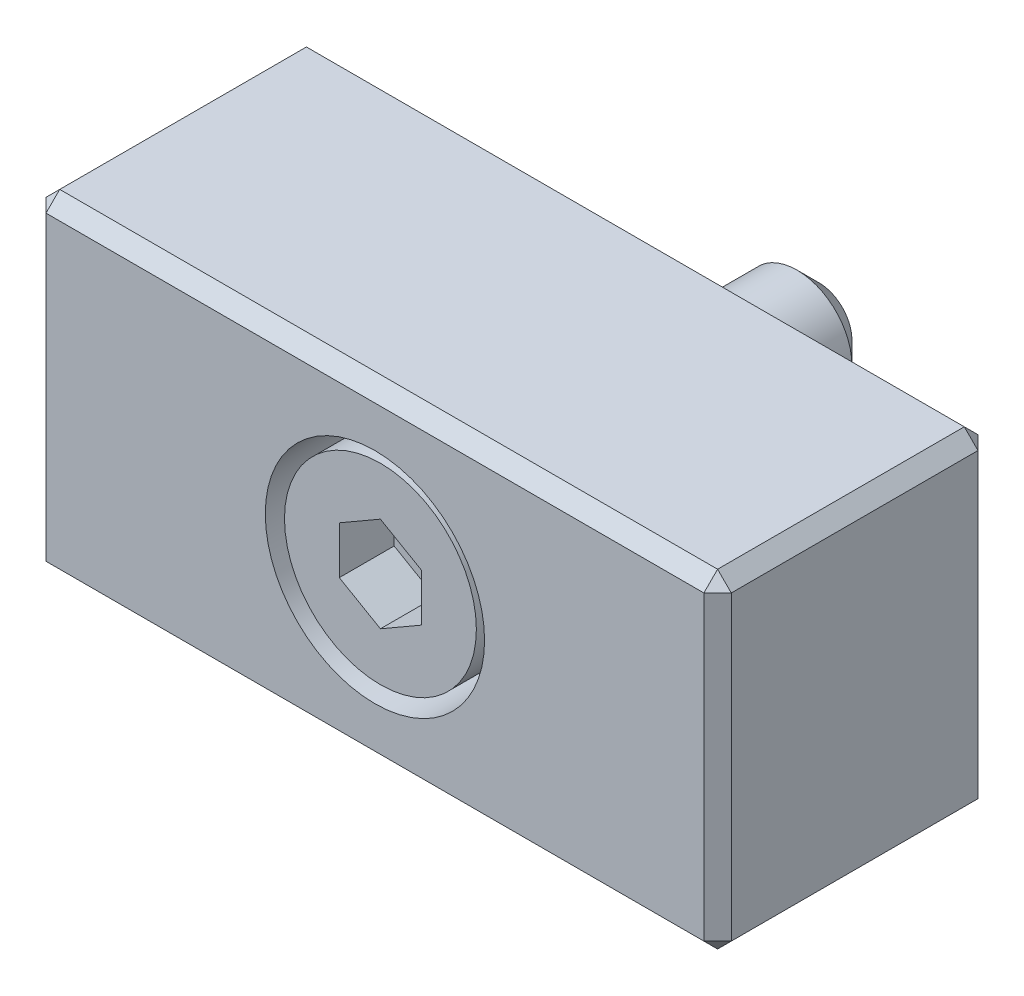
ISO-10303-21;
HEADER;
FILE_DESCRIPTION(('STEP AP214'),'2;1');
FILE_NAME('part.step','',(''),(''),'','','');
FILE_SCHEMA(('AUTOMOTIVE_DESIGN { 1 0 10303 214 1 1 1 1 }'));
ENDSEC;
DATA;
#1=APPLICATION_CONTEXT('core data for automotive mechanical design processes');
#2=APPLICATION_PROTOCOL_DEFINITION('international standard','automotive_design',2000,#1);
#3=PRODUCT_CONTEXT('',#1,'mechanical');
#4=PRODUCT('Part','Part','',(#3));
#5=PRODUCT_RELATED_PRODUCT_CATEGORY('part','',(#4));
#6=PRODUCT_DEFINITION_FORMATION('','',#4);
#7=PRODUCT_DEFINITION_CONTEXT('part definition',#1,'design');
#8=PRODUCT_DEFINITION('design','',#6,#7);
#9=PRODUCT_DEFINITION_SHAPE('','',#8);
#10=(LENGTH_UNIT() NAMED_UNIT(*) SI_UNIT(.MILLI.,.METRE.));
#11=(NAMED_UNIT(*) PLANE_ANGLE_UNIT() SI_UNIT($,.RADIAN.));
#12=(NAMED_UNIT(*) SI_UNIT($,.STERADIAN.) SOLID_ANGLE_UNIT());
#13=UNCERTAINTY_MEASURE_WITH_UNIT(LENGTH_MEASURE(1.E-05),#10,'distance_accuracy_value','');
#14=(GEOMETRIC_REPRESENTATION_CONTEXT(3) GLOBAL_UNCERTAINTY_ASSIGNED_CONTEXT((#13)) GLOBAL_UNIT_ASSIGNED_CONTEXT((#10,
#11,#12)) REPRESENTATION_CONTEXT('',''));
#15=CARTESIAN_POINT('',(0.,0.,0.));
#16=DIRECTION('',(0.,0.,1.));
#17=DIRECTION('',(1.,0.,0.));
#18=AXIS2_PLACEMENT_3D('',#15,#16,#17);
#19=CARTESIAN_POINT('',(2.,0.,-6.2));
#20=DIRECTION('',(0.,0.,-1.));
#21=DIRECTION('',(-1.,0.,0.));
#22=AXIS2_PLACEMENT_3D('',#19,#20,#21);
#23=PLANE('',#22);
#24=CARTESIAN_POINT('',(0.,0.,-6.2));
#25=DIRECTION('',(0.,0.,-1.));
#26=DIRECTION('',(-1.,0.,0.));
#27=AXIS2_PLACEMENT_3D('',#24,#25,#26);
#28=CIRCLE('',#27,1.2);
#29=CARTESIAN_POINT('',(-1.2,0.,-6.2));
#30=VERTEX_POINT('',#29);
#31=EDGE_CURVE('E24',#30,#30,#28,.T.);
#32=ORIENTED_EDGE('',*,*,#31,.T.);
#33=EDGE_LOOP('',(#32));
#34=FACE_BOUND('',#33,.T.);
#35=ADVANCED_FACE('F14',(#34),#23,.T.);
#36=CARTESIAN_POINT('',(0.,0.,-5.4));
#37=DIRECTION('',(0.,0.,1.));
#38=DIRECTION('',(1.,0.,0.));
#39=AXIS2_PLACEMENT_3D('',#36,#37,#38);
#40=CONICAL_SURFACE('',#39,2.,0.785398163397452);
#41=ORIENTED_EDGE('',*,*,#31,.F.);
#42=EDGE_LOOP('',(#41));
#43=FACE_BOUND('',#42,.T.);
#44=CARTESIAN_POINT('',(0.,0.,-5.4));
#45=DIRECTION('',(0.,0.,-1.));
#46=DIRECTION('',(-1.,0.,0.));
#47=AXIS2_PLACEMENT_3D('',#44,#45,#46);
#48=CIRCLE('',#47,2.);
#49=CARTESIAN_POINT('',(-2.,0.,-5.4));
#50=VERTEX_POINT('',#49);
#51=EDGE_CURVE('E199',#50,#50,#48,.F.);
#52=ORIENTED_EDGE('',*,*,#51,.F.);
#53=EDGE_LOOP('',(#52));
#54=FACE_BOUND('',#53,.T.);
#55=ADVANCED_FACE('F437',(#43,#54),#40,.T.);
#56=CARTESIAN_POINT('',(0.,0.,13.8));
#57=DIRECTION('',(0.,0.,1.));
#58=DIRECTION('',(1.,0.,0.));
#59=AXIS2_PLACEMENT_3D('',#56,#57,#58);
#60=CYLINDRICAL_SURFACE('',#59,2.);
#61=ORIENTED_EDGE('',*,*,#51,.T.);
#62=EDGE_LOOP('',(#61));
#63=FACE_BOUND('',#62,.T.);
#64=CARTESIAN_POINT('',(0.,0.,5.8));
#65=DIRECTION('',(0.,0.,1.));
#66=DIRECTION('',(1.,0.,0.));
#67=AXIS2_PLACEMENT_3D('',#64,#65,#66);
#68=CIRCLE('',#67,2.);
#69=CARTESIAN_POINT('',(2.,0.,5.8));
#70=VERTEX_POINT('',#69);
#71=EDGE_CURVE('E190',#70,#70,#68,.T.);
#72=ORIENTED_EDGE('',*,*,#71,.F.);
#73=EDGE_LOOP('',(#72));
#74=FACE_BOUND('',#73,.T.);
#75=ADVANCED_FACE('F444',(#63,#74),#60,.T.);
#76=CARTESIAN_POINT('',(3.5,0.,5.8));
#77=DIRECTION('',(0.,0.,-1.));
#78=DIRECTION('',(-1.,0.,0.));
#79=AXIS2_PLACEMENT_3D('',#76,#77,#78);
#80=PLANE('',#79);
#81=ORIENTED_EDGE('',*,*,#71,.T.);
#82=EDGE_LOOP('',(#81));
#83=FACE_BOUND('',#82,.T.);
#84=CARTESIAN_POINT('',(0.,0.,5.8));
#85=DIRECTION('',(0.,0.,-1.));
#86=DIRECTION('',(-1.,0.,0.));
#87=AXIS2_PLACEMENT_3D('',#84,#85,#86);
#88=CIRCLE('',#87,2.5);
#89=CARTESIAN_POINT('',(-2.5,0.,5.8));
#90=VERTEX_POINT('',#89);
#91=EDGE_CURVE('E9',#90,#90,#88,.T.);
#92=ORIENTED_EDGE('',*,*,#91,.T.);
#93=EDGE_LOOP('',(#92));
#94=FACE_BOUND('',#93,.T.);
#95=ADVANCED_FACE('F453',(#83,#94),#80,.T.);
#96=CARTESIAN_POINT('',(0.,1.73205080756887,7.8));
#97=DIRECTION('',(-0.5,-0.86602540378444,0.));
#98=DIRECTION('',(0.86602540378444,-0.5,0.));
#99=AXIS2_PLACEMENT_3D('',#96,#97,#98);
#100=PLANE('',#99);
#101=DIRECTION('',(0.,0.,1.));
#102=VECTOR('',#101,1.);
#103=CARTESIAN_POINT('',(1.5,0.866025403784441,7.8));
#104=LINE('',#103,#102);
#105=CARTESIAN_POINT('',(1.5,0.866025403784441,7.8));
#106=VERTEX_POINT('',#105);
#107=CARTESIAN_POINT('',(1.5,0.866025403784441,9.8));
#108=VERTEX_POINT('',#107);
#109=EDGE_CURVE('E119',#106,#108,#104,.T.);
#110=ORIENTED_EDGE('',*,*,#109,.T.);
#111=DIRECTION('',(0.86602540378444,-0.5,0.));
#112=VECTOR('',#111,1.);
#113=CARTESIAN_POINT('',(0.,1.73205080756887,9.8));
#114=LINE('',#113,#112);
#115=CARTESIAN_POINT('',(0.,1.73205080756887,9.8));
#116=VERTEX_POINT('',#115);
#117=EDGE_CURVE('E33',#116,#108,#114,.T.);
#118=ORIENTED_EDGE('',*,*,#117,.F.);
#119=DIRECTION('',(0.,0.,1.));
#120=VECTOR('',#119,1.);
#121=CARTESIAN_POINT('',(0.,1.73205080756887,7.8));
#122=LINE('',#121,#120);
#123=CARTESIAN_POINT('',(0.,1.73205080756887,7.8));
#124=VERTEX_POINT('',#123);
#125=EDGE_CURVE('E158',#124,#116,#122,.T.);
#126=ORIENTED_EDGE('',*,*,#125,.F.);
#127=DIRECTION('',(0.86602540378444,-0.5,0.));
#128=VECTOR('',#127,1.);
#129=CARTESIAN_POINT('',(0.,1.73205080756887,7.8));
#130=LINE('',#129,#128);
#131=EDGE_CURVE('E171',#124,#106,#130,.T.);
#132=ORIENTED_EDGE('',*,*,#131,.T.);
#133=EDGE_LOOP('',(#110,#118,#126,#132));
#134=FACE_BOUND('',#133,.T.);
#135=ADVANCED_FACE('F457',(#134),#100,.T.);
#136=CARTESIAN_POINT('',(1.5,-0.866025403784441,7.8));
#137=DIRECTION('',(1.,0.,0.));
#138=DIRECTION('',(0.,1.,0.));
#139=AXIS2_PLACEMENT_3D('',#136,#137,#138);
#140=PLANE('',#139);
#141=DIRECTION('',(0.,0.,1.));
#142=VECTOR('',#141,1.);
#143=CARTESIAN_POINT('',(1.5,-0.866025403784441,7.8));
#144=LINE('',#143,#142);
#145=CARTESIAN_POINT('',(1.5,-0.866025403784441,7.8));
#146=VERTEX_POINT('',#145);
#147=CARTESIAN_POINT('',(1.5,-0.866025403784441,9.8));
#148=VERTEX_POINT('',#147);
#149=EDGE_CURVE('E187',#146,#148,#144,.T.);
#150=ORIENTED_EDGE('',*,*,#149,.T.);
#151=DIRECTION('',(0.,1.,0.));
#152=VECTOR('',#151,1.);
#153=CARTESIAN_POINT('',(1.5,-0.866025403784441,9.8));
#154=LINE('',#153,#152);
#155=EDGE_CURVE('E759',#148,#108,#154,.T.);
#156=ORIENTED_EDGE('',*,*,#155,.T.);
#157=ORIENTED_EDGE('',*,*,#109,.F.);
#158=DIRECTION('',(0.,1.,0.));
#159=VECTOR('',#158,1.);
#160=CARTESIAN_POINT('',(1.5,-0.866025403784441,7.8));
#161=LINE('',#160,#159);
#162=EDGE_CURVE('E181',#146,#106,#161,.T.);
#163=ORIENTED_EDGE('',*,*,#162,.F.);
#164=EDGE_LOOP('',(#150,#156,#157,#163));
#165=FACE_BOUND('',#164,.T.);
#166=ADVANCED_FACE('F449',(#165),#140,.F.);
#167=CARTESIAN_POINT('',(0.,-1.73205080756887,7.8));
#168=DIRECTION('',(0.5,-0.86602540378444,0.));
#169=DIRECTION('',(0.86602540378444,0.5,0.));
#170=AXIS2_PLACEMENT_3D('',#167,#168,#169);
#171=PLANE('',#170);
#172=DIRECTION('',(0.,0.,1.));
#173=VECTOR('',#172,1.);
#174=CARTESIAN_POINT('',(0.,-1.73205080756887,7.8));
#175=LINE('',#174,#173);
#176=CARTESIAN_POINT('',(0.,-1.73205080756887,7.8));
#177=VERTEX_POINT('',#176);
#178=CARTESIAN_POINT('',(0.,-1.73205080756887,9.8));
#179=VERTEX_POINT('',#178);
#180=EDGE_CURVE('E185',#177,#179,#175,.T.);
#181=ORIENTED_EDGE('',*,*,#180,.T.);
#182=DIRECTION('',(0.86602540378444,0.5,0.));
#183=VECTOR('',#182,1.);
#184=CARTESIAN_POINT('',(0.,-1.73205080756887,9.8));
#185=LINE('',#184,#183);
#186=EDGE_CURVE('E762',#179,#148,#185,.T.);
#187=ORIENTED_EDGE('',*,*,#186,.T.);
#188=ORIENTED_EDGE('',*,*,#149,.F.);
#189=DIRECTION('',(0.86602540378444,0.5,0.));
#190=VECTOR('',#189,1.);
#191=CARTESIAN_POINT('',(0.,-1.73205080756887,7.8));
#192=LINE('',#191,#190);
#193=EDGE_CURVE('E178',#177,#146,#192,.T.);
#194=ORIENTED_EDGE('',*,*,#193,.F.);
#195=EDGE_LOOP('',(#181,#187,#188,#194));
#196=FACE_BOUND('',#195,.T.);
#197=ADVANCED_FACE('F723',(#196),#171,.F.);
#198=CARTESIAN_POINT('',(0.,-1.73205080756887,7.8));
#199=DIRECTION('',(0.5,0.86602540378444,0.));
#200=DIRECTION('',(-0.86602540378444,0.5,0.));
#201=AXIS2_PLACEMENT_3D('',#198,#199,#200);
#202=PLANE('',#201);
#203=DIRECTION('',(0.,0.,1.));
#204=VECTOR('',#203,1.);
#205=CARTESIAN_POINT('',(-1.5,-0.866025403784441,7.8));
#206=LINE('',#205,#204);
#207=CARTESIAN_POINT('',(-1.5,-0.866025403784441,7.8));
#208=VERTEX_POINT('',#207);
#209=CARTESIAN_POINT('',(-1.5,-0.866025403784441,9.8));
#210=VERTEX_POINT('',#209);
#211=EDGE_CURVE('E157',#208,#210,#206,.T.);
#212=ORIENTED_EDGE('',*,*,#211,.T.);
#213=DIRECTION('',(-0.86602540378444,0.5,0.));
#214=VECTOR('',#213,1.);
#215=CARTESIAN_POINT('',(0.,-1.73205080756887,9.8));
#216=LINE('',#215,#214);
#217=EDGE_CURVE('E766',#179,#210,#216,.T.);
#218=ORIENTED_EDGE('',*,*,#217,.F.);
#219=ORIENTED_EDGE('',*,*,#180,.F.);
#220=DIRECTION('',(-0.86602540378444,0.5,0.));
#221=VECTOR('',#220,1.);
#222=CARTESIAN_POINT('',(0.,-1.73205080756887,7.8));
#223=LINE('',#222,#221);
#224=EDGE_CURVE('E166',#177,#208,#223,.T.);
#225=ORIENTED_EDGE('',*,*,#224,.T.);
#226=EDGE_LOOP('',(#212,#218,#219,#225));
#227=FACE_BOUND('',#226,.T.);
#228=ADVANCED_FACE('F714',(#227),#202,.T.);
#229=CARTESIAN_POINT('',(-1.5,0.866025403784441,7.8));
#230=DIRECTION('',(-1.,0.,0.));
#231=DIRECTION('',(0.,-1.,0.));
#232=AXIS2_PLACEMENT_3D('',#229,#230,#231);
#233=PLANE('',#232);
#234=DIRECTION('',(0.,0.,1.));
#235=VECTOR('',#234,1.);
#236=CARTESIAN_POINT('',(-1.5,0.866025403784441,7.8));
#237=LINE('',#236,#235);
#238=CARTESIAN_POINT('',(-1.5,0.866025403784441,7.8));
#239=VERTEX_POINT('',#238);
#240=CARTESIAN_POINT('',(-1.5,0.866025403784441,9.8));
#241=VERTEX_POINT('',#240);
#242=EDGE_CURVE('E147',#239,#241,#237,.T.);
#243=ORIENTED_EDGE('',*,*,#242,.T.);
#244=DIRECTION('',(0.,-1.,0.));
#245=VECTOR('',#244,1.);
#246=CARTESIAN_POINT('',(-1.5,0.866025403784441,9.8));
#247=LINE('',#246,#245);
#248=EDGE_CURVE('E770',#241,#210,#247,.T.);
#249=ORIENTED_EDGE('',*,*,#248,.T.);
#250=ORIENTED_EDGE('',*,*,#211,.F.);
#251=DIRECTION('',(0.,-1.,0.));
#252=VECTOR('',#251,1.);
#253=CARTESIAN_POINT('',(-1.5,0.866025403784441,7.8));
#254=LINE('',#253,#252);
#255=EDGE_CURVE('E161',#239,#208,#254,.T.);
#256=ORIENTED_EDGE('',*,*,#255,.F.);
#257=EDGE_LOOP('',(#243,#249,#250,#256));
#258=FACE_BOUND('',#257,.T.);
#259=ADVANCED_FACE('F162',(#258),#233,.F.);
#260=CARTESIAN_POINT('',(0.,1.73205080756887,7.8));
#261=DIRECTION('',(-0.5,0.86602540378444,0.));
#262=DIRECTION('',(-0.86602540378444,-0.5,0.));
#263=AXIS2_PLACEMENT_3D('',#260,#261,#262);
#264=PLANE('',#263);
#265=DIRECTION('',(-0.86602540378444,-0.5,0.));
#266=VECTOR('',#265,1.);
#267=CARTESIAN_POINT('',(0.,1.73205080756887,7.8));
#268=LINE('',#267,#266);
#269=EDGE_CURVE('E151',#124,#239,#268,.T.);
#270=ORIENTED_EDGE('',*,*,#269,.F.);
#271=ORIENTED_EDGE('',*,*,#125,.T.);
#272=DIRECTION('',(-0.86602540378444,-0.5,0.));
#273=VECTOR('',#272,1.);
#274=CARTESIAN_POINT('',(0.,1.73205080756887,9.8));
#275=LINE('',#274,#273);
#276=EDGE_CURVE('E153',#116,#241,#275,.T.);
#277=ORIENTED_EDGE('',*,*,#276,.T.);
#278=ORIENTED_EDGE('',*,*,#242,.F.);
#279=EDGE_LOOP('',(#270,#271,#277,#278));
#280=FACE_BOUND('',#279,.T.);
#281=ADVANCED_FACE('F149',(#280),#264,.F.);
#282=CARTESIAN_POINT('',(1.5,0.866025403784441,7.8));
#283=DIRECTION('',(0.,0.,1.));
#284=DIRECTION('',(1.,0.,0.));
#285=AXIS2_PLACEMENT_3D('',#282,#283,#284);
#286=PLANE('',#285);
#287=ORIENTED_EDGE('',*,*,#131,.F.);
#288=ORIENTED_EDGE('',*,*,#269,.T.);
#289=ORIENTED_EDGE('',*,*,#255,.T.);
#290=ORIENTED_EDGE('',*,*,#224,.F.);
#291=ORIENTED_EDGE('',*,*,#193,.T.);
#292=ORIENTED_EDGE('',*,*,#162,.T.);
#293=EDGE_LOOP('',(#287,#288,#289,#290,#291,#292));
#294=FACE_BOUND('',#293,.T.);
#295=ADVANCED_FACE('F169',(#294),#286,.T.);
#296=CARTESIAN_POINT('',(0.,0.,9.8));
#297=DIRECTION('',(0.,0.,1.));
#298=DIRECTION('',(1.,0.,0.));
#299=AXIS2_PLACEMENT_3D('',#296,#297,#298);
#300=PLANE('',#299);
#301=CARTESIAN_POINT('',(0.,0.,9.8));
#302=DIRECTION('',(0.,0.,1.));
#303=DIRECTION('',(1.,0.,0.));
#304=AXIS2_PLACEMENT_3D('',#301,#302,#303);
#305=CIRCLE('',#304,3.5);
#306=CARTESIAN_POINT('',(3.5,0.,9.8));
#307=VERTEX_POINT('',#306);
#308=EDGE_CURVE('E196',#307,#307,#305,.T.);
#309=ORIENTED_EDGE('',*,*,#308,.T.);
#310=EDGE_LOOP('',(#309));
#311=FACE_BOUND('',#310,.T.);
#312=ORIENTED_EDGE('',*,*,#276,.F.);
#313=ORIENTED_EDGE('',*,*,#117,.T.);
#314=ORIENTED_EDGE('',*,*,#155,.F.);
#315=ORIENTED_EDGE('',*,*,#186,.F.);
#316=ORIENTED_EDGE('',*,*,#217,.T.);
#317=ORIENTED_EDGE('',*,*,#248,.F.);
#318=EDGE_LOOP('',(#312,#313,#314,#315,#316,#317));
#319=FACE_BOUND('',#318,.T.);
#320=ADVANCED_FACE('F463',(#311,#319),#300,.T.);
#321=CARTESIAN_POINT('',(0.,0.,13.8));
#322=DIRECTION('',(0.,0.,1.));
#323=DIRECTION('',(1.,0.,0.));
#324=AXIS2_PLACEMENT_3D('',#321,#322,#323);
#325=CYLINDRICAL_SURFACE('',#324,3.5);
#326=CARTESIAN_POINT('',(0.,0.,5.8));
#327=DIRECTION('',(0.,0.,1.));
#328=DIRECTION('',(1.,0.,0.));
#329=AXIS2_PLACEMENT_3D('',#326,#327,#328);
#330=CIRCLE('',#329,3.5);
#331=CARTESIAN_POINT('',(3.5,0.,5.8));
#332=VERTEX_POINT('',#331);
#333=EDGE_CURVE('E193',#332,#332,#330,.T.);
#334=ORIENTED_EDGE('',*,*,#333,.T.);
#335=EDGE_LOOP('',(#334));
#336=FACE_BOUND('',#335,.T.);
#337=ORIENTED_EDGE('',*,*,#308,.F.);
#338=EDGE_LOOP('',(#337));
#339=FACE_BOUND('',#338,.T.);
#340=ADVANCED_FACE('F460',(#336,#339),#325,.T.);
#341=CARTESIAN_POINT('',(12.,5.5,10.));
#342=DIRECTION('',(0.577350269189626,0.577350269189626,0.577350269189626));
#343=DIRECTION('',(0.707106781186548,0.,-0.707106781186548));
#344=AXIS2_PLACEMENT_3D('',#341,#342,#343);
#345=PLANE('',#344);
#346=DIRECTION('',(-0.707106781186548,0.,0.707106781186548));
#347=VECTOR('',#346,1.);
#348=CARTESIAN_POINT('',(12.,5.5,10.));
#349=LINE('',#348,#347);
#350=CARTESIAN_POINT('',(12.,5.5,10.));
#351=VERTEX_POINT('',#350);
#352=CARTESIAN_POINT('',(12.5,5.5,9.5));
#353=VERTEX_POINT('',#352);
#354=EDGE_CURVE('E302',#351,#353,#349,.F.);
#355=ORIENTED_EDGE('',*,*,#354,.T.);
#356=DIRECTION('',(0.707106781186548,-0.707106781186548,0.));
#357=VECTOR('',#356,1.);
#358=CARTESIAN_POINT('',(12.25,5.75,9.5));
#359=LINE('',#358,#357);
#360=CARTESIAN_POINT('',(12.,6.,9.5));
#361=VERTEX_POINT('',#360);
#362=EDGE_CURVE('E305',#353,#361,#359,.F.);
#363=ORIENTED_EDGE('',*,*,#362,.T.);
#364=DIRECTION('',(0.,0.707106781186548,-0.707106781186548));
#365=VECTOR('',#364,1.);
#366=CARTESIAN_POINT('',(12.,5.5,10.));
#367=LINE('',#366,#365);
#368=EDGE_CURVE('E285',#351,#361,#367,.T.);
#369=ORIENTED_EDGE('',*,*,#368,.F.);
#370=EDGE_LOOP('',(#355,#363,#369));
#371=FACE_BOUND('',#370,.T.);
#372=ADVANCED_FACE('F351',(#371),#345,.T.);
#373=CARTESIAN_POINT('',(12.5,-5.5,9.5));
#374=DIRECTION('',(0.577350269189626,-0.577350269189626,0.577350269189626));
#375=DIRECTION('',(0.707106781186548,0.,-0.707106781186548));
#376=AXIS2_PLACEMENT_3D('',#373,#374,#375);
#377=PLANE('',#376);
#378=DIRECTION('',(-0.707106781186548,-0.707106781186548,0.));
#379=VECTOR('',#378,1.);
#380=CARTESIAN_POINT('',(12.5,-5.5,9.5));
#381=LINE('',#380,#379);
#382=CARTESIAN_POINT('',(12.,-6.,9.5));
#383=VERTEX_POINT('',#382);
#384=CARTESIAN_POINT('',(12.5,-5.5,9.5));
#385=VERTEX_POINT('',#384);
#386=EDGE_CURVE('E297',#383,#385,#381,.F.);
#387=ORIENTED_EDGE('',*,*,#386,.T.);
#388=DIRECTION('',(0.707106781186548,0.,-0.707106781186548));
#389=VECTOR('',#388,1.);
#390=CARTESIAN_POINT('',(12.5,-5.5,9.5));
#391=LINE('',#390,#389);
#392=CARTESIAN_POINT('',(12.,-5.5,10.));
#393=VERTEX_POINT('',#392);
#394=EDGE_CURVE('E299',#385,#393,#391,.F.);
#395=ORIENTED_EDGE('',*,*,#394,.T.);
#396=DIRECTION('',(0.,0.707106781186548,0.707106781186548));
#397=VECTOR('',#396,1.);
#398=CARTESIAN_POINT('',(12.,-5.75,9.75));
#399=LINE('',#398,#397);
#400=EDGE_CURVE('E282',#383,#393,#399,.T.);
#401=ORIENTED_EDGE('',*,*,#400,.F.);
#402=EDGE_LOOP('',(#387,#395,#401));
#403=FACE_BOUND('',#402,.T.);
#404=ADVANCED_FACE('F409',(#403),#377,.T.);
#405=CARTESIAN_POINT('',(-12.,-5.5,10.));
#406=DIRECTION('',(-0.577350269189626,-0.577350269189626,0.577350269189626));
#407=DIRECTION('',(0.707106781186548,0.,0.707106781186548));
#408=AXIS2_PLACEMENT_3D('',#405,#406,#407);
#409=PLANE('',#408);
#410=DIRECTION('',(-0.707106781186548,0.707106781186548,0.));
#411=VECTOR('',#410,1.);
#412=CARTESIAN_POINT('',(-12.25,-5.75,9.5));
#413=LINE('',#412,#411);
#414=CARTESIAN_POINT('',(-12.5,-5.5,9.5));
#415=VERTEX_POINT('',#414);
#416=CARTESIAN_POINT('',(-12.,-6.,9.5));
#417=VERTEX_POINT('',#416);
#418=EDGE_CURVE('E268',#415,#417,#413,.F.);
#419=ORIENTED_EDGE('',*,*,#418,.T.);
#420=DIRECTION('',(0.,-0.707106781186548,-0.707106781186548));
#421=VECTOR('',#420,1.);
#422=CARTESIAN_POINT('',(-12.,-5.5,10.));
#423=LINE('',#422,#421);
#424=CARTESIAN_POINT('',(-12.,-5.5,10.));
#425=VERTEX_POINT('',#424);
#426=EDGE_CURVE('E271',#417,#425,#423,.F.);
#427=ORIENTED_EDGE('',*,*,#426,.T.);
#428=DIRECTION('',(0.707106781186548,0.,0.707106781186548));
#429=VECTOR('',#428,1.);
#430=CARTESIAN_POINT('',(-12.,-5.5,10.));
#431=LINE('',#430,#429);
#432=EDGE_CURVE('E207',#415,#425,#431,.T.);
#433=ORIENTED_EDGE('',*,*,#432,.F.);
#434=EDGE_LOOP('',(#419,#427,#433));
#435=FACE_BOUND('',#434,.T.);
#436=ADVANCED_FACE('F402',(#435),#409,.T.);
#437=CARTESIAN_POINT('',(-12.5,5.5,9.5));
#438=DIRECTION('',(-0.577350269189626,0.577350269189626,0.577350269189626));
#439=DIRECTION('',(0.707106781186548,0.,0.707106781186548));
#440=AXIS2_PLACEMENT_3D('',#437,#438,#439);
#441=PLANE('',#440);
#442=DIRECTION('',(0.,-0.707106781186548,0.707106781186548));
#443=VECTOR('',#442,1.);
#444=CARTESIAN_POINT('',(-12.,5.75,9.75));
#445=LINE('',#444,#443);
#446=CARTESIAN_POINT('',(-12.,5.5,10.));
#447=VERTEX_POINT('',#446);
#448=CARTESIAN_POINT('',(-12.,6.,9.5));
#449=VERTEX_POINT('',#448);
#450=EDGE_CURVE('E274',#447,#449,#445,.F.);
#451=ORIENTED_EDGE('',*,*,#450,.T.);
#452=DIRECTION('',(0.707106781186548,0.707106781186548,0.));
#453=VECTOR('',#452,1.);
#454=CARTESIAN_POINT('',(-12.5,5.5,9.5));
#455=LINE('',#454,#453);
#456=CARTESIAN_POINT('',(-12.5,5.5,9.5));
#457=VERTEX_POINT('',#456);
#458=EDGE_CURVE('E277',#449,#457,#455,.F.);
#459=ORIENTED_EDGE('',*,*,#458,.T.);
#460=DIRECTION('',(-0.707106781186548,0.,-0.707106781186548));
#461=VECTOR('',#460,1.);
#462=CARTESIAN_POINT('',(-12.5,5.5,9.5));
#463=LINE('',#462,#461);
#464=EDGE_CURVE('E266',#447,#457,#463,.T.);
#465=ORIENTED_EDGE('',*,*,#464,.F.);
#466=EDGE_LOOP('',(#451,#459,#465));
#467=FACE_BOUND('',#466,.T.);
#468=ADVANCED_FACE('F395',(#467),#441,.T.);
#469=CARTESIAN_POINT('',(12.,6.,10.));
#470=DIRECTION('',(-0.707106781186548,-0.707106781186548,0.));
#471=DIRECTION('',(0.,0.,-1.));
#472=AXIS2_PLACEMENT_3D('',#469,#470,#471);
#473=PLANE('',#472);
#474=DIRECTION('',(-0.707106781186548,0.707106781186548,0.));
#475=VECTOR('',#474,1.);
#476=CARTESIAN_POINT('',(12.5,5.5,0.5));
#477=LINE('',#476,#475);
#478=CARTESIAN_POINT('',(12.5,5.5,0.5));
#479=VERTEX_POINT('',#478);
#480=CARTESIAN_POINT('',(12.,6.,0.5));
#481=VERTEX_POINT('',#480);
#482=EDGE_CURVE('E319',#479,#481,#477,.T.);
#483=ORIENTED_EDGE('',*,*,#482,.T.);
#484=DIRECTION('',(0.,0.,-1.));
#485=VECTOR('',#484,1.);
#486=CARTESIAN_POINT('',(12.,6.,10.));
#487=LINE('',#486,#485);
#488=EDGE_CURVE('E263',#361,#481,#487,.T.);
#489=ORIENTED_EDGE('',*,*,#488,.F.);
#490=ORIENTED_EDGE('',*,*,#362,.F.);
#491=DIRECTION('',(0.,0.,1.));
#492=VECTOR('',#491,1.);
#493=CARTESIAN_POINT('',(12.5,5.5,10.));
#494=LINE('',#493,#492);
#495=EDGE_CURVE('E241',#479,#353,#494,.T.);
#496=ORIENTED_EDGE('',*,*,#495,.F.);
#497=EDGE_LOOP('',(#483,#489,#490,#496));
#498=FACE_BOUND('',#497,.T.);
#499=ADVANCED_FACE('F348',(#498),#473,.F.);
#500=CARTESIAN_POINT('',(-12.5,5.5,10.));
#501=DIRECTION('',(0.707106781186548,-0.707106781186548,0.));
#502=DIRECTION('',(0.,0.,-1.));
#503=AXIS2_PLACEMENT_3D('',#500,#501,#502);
#504=PLANE('',#503);
#505=DIRECTION('',(-0.707106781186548,-0.707106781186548,0.));
#506=VECTOR('',#505,1.);
#507=CARTESIAN_POINT('',(-12.25,5.75,0.5));
#508=LINE('',#507,#506);
#509=CARTESIAN_POINT('',(-12.,6.,0.5));
#510=VERTEX_POINT('',#509);
#511=CARTESIAN_POINT('',(-12.5,5.5,0.5));
#512=VERTEX_POINT('',#511);
#513=EDGE_CURVE('E288',#510,#512,#508,.T.);
#514=ORIENTED_EDGE('',*,*,#513,.T.);
#515=DIRECTION('',(0.,0.,-1.));
#516=VECTOR('',#515,1.);
#517=CARTESIAN_POINT('',(-12.5,5.5,10.));
#518=LINE('',#517,#516);
#519=EDGE_CURVE('E223',#457,#512,#518,.T.);
#520=ORIENTED_EDGE('',*,*,#519,.F.);
#521=ORIENTED_EDGE('',*,*,#458,.F.);
#522=DIRECTION('',(0.,0.,1.));
#523=VECTOR('',#522,1.);
#524=CARTESIAN_POINT('',(-12.,6.,10.));
#525=LINE('',#524,#523);
#526=EDGE_CURVE('E109',#510,#449,#525,.T.);
#527=ORIENTED_EDGE('',*,*,#526,.F.);
#528=EDGE_LOOP('',(#514,#520,#521,#527));
#529=FACE_BOUND('',#528,.T.);
#530=ADVANCED_FACE('F393',(#529),#504,.F.);
#531=CARTESIAN_POINT('',(-12.,-6.,10.));
#532=DIRECTION('',(0.707106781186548,0.707106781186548,0.));
#533=DIRECTION('',(0.,0.,-1.));
#534=AXIS2_PLACEMENT_3D('',#531,#532,#533);
#535=PLANE('',#534);
#536=DIRECTION('',(0.707106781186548,-0.707106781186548,0.));
#537=VECTOR('',#536,1.);
#538=CARTESIAN_POINT('',(-12.5,-5.5,0.5));
#539=LINE('',#538,#537);
#540=CARTESIAN_POINT('',(-12.5,-5.5,0.5));
#541=VERTEX_POINT('',#540);
#542=CARTESIAN_POINT('',(-12.,-6.,0.5));
#543=VERTEX_POINT('',#542);
#544=EDGE_CURVE('E280',#541,#543,#539,.T.);
#545=ORIENTED_EDGE('',*,*,#544,.T.);
#546=DIRECTION('',(0.,0.,-1.));
#547=VECTOR('',#546,1.);
#548=CARTESIAN_POINT('',(-12.,-6.,10.));
#549=LINE('',#548,#547);
#550=EDGE_CURVE('E256',#417,#543,#549,.T.);
#551=ORIENTED_EDGE('',*,*,#550,.F.);
#552=ORIENTED_EDGE('',*,*,#418,.F.);
#553=DIRECTION('',(0.,0.,1.));
#554=VECTOR('',#553,1.);
#555=CARTESIAN_POINT('',(-12.5,-5.5,10.));
#556=LINE('',#555,#554);
#557=EDGE_CURVE('E230',#541,#415,#556,.T.);
#558=ORIENTED_EDGE('',*,*,#557,.F.);
#559=EDGE_LOOP('',(#545,#551,#552,#558));
#560=FACE_BOUND('',#559,.T.);
#561=ADVANCED_FACE('F417',(#560),#535,.F.);
#562=CARTESIAN_POINT('',(-12.5,5.5,10.));
#563=DIRECTION('',(0.,-0.707106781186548,-0.707106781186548));
#564=DIRECTION('',(-1.,0.,0.));
#565=AXIS2_PLACEMENT_3D('',#562,#563,#564);
#566=PLANE('',#565);
#567=ORIENTED_EDGE('',*,*,#368,.T.);
#568=DIRECTION('',(1.,0.,0.));
#569=VECTOR('',#568,1.);
#570=CARTESIAN_POINT('',(-12.5,6.,9.5));
#571=LINE('',#570,#569);
#572=EDGE_CURVE('E113',#449,#361,#571,.T.);
#573=ORIENTED_EDGE('',*,*,#572,.F.);
#574=ORIENTED_EDGE('',*,*,#450,.F.);
#575=DIRECTION('',(-1.,0.,0.));
#576=VECTOR('',#575,1.);
#577=CARTESIAN_POINT('',(-12.5,5.5,10.));
#578=LINE('',#577,#576);
#579=EDGE_CURVE('E214',#351,#447,#578,.T.);
#580=ORIENTED_EDGE('',*,*,#579,.F.);
#581=EDGE_LOOP('',(#567,#573,#574,#580));
#582=FACE_BOUND('',#581,.T.);
#583=ADVANCED_FACE('F355',(#582),#566,.F.);
#584=CARTESIAN_POINT('',(12.,-6.,10.));
#585=DIRECTION('',(-0.707106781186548,0.,-0.707106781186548));
#586=DIRECTION('',(0.,1.,0.));
#587=AXIS2_PLACEMENT_3D('',#584,#585,#586);
#588=PLANE('',#587);
#589=ORIENTED_EDGE('',*,*,#394,.F.);
#590=DIRECTION('',(0.,-1.,0.));
#591=VECTOR('',#590,1.);
#592=CARTESIAN_POINT('',(12.5,-6.,9.5));
#593=LINE('',#592,#591);
#594=EDGE_CURVE('E247',#353,#385,#593,.T.);
#595=ORIENTED_EDGE('',*,*,#594,.F.);
#596=ORIENTED_EDGE('',*,*,#354,.F.);
#597=DIRECTION('',(0.,1.,0.));
#598=VECTOR('',#597,1.);
#599=CARTESIAN_POINT('',(12.,-6.,10.));
#600=LINE('',#599,#598);
#601=EDGE_CURVE('E216',#393,#351,#600,.T.);
#602=ORIENTED_EDGE('',*,*,#601,.F.);
#603=EDGE_LOOP('',(#589,#595,#596,#602));
#604=FACE_BOUND('',#603,.T.);
#605=ADVANCED_FACE('F368',(#604),#588,.F.);
#606=CARTESIAN_POINT('',(-12.5,-5.5,10.));
#607=DIRECTION('',(0.,0.707106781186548,-0.707106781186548));
#608=DIRECTION('',(1.,0.,0.));
#609=AXIS2_PLACEMENT_3D('',#606,#607,#608);
#610=PLANE('',#609);
#611=ORIENTED_EDGE('',*,*,#400,.T.);
#612=DIRECTION('',(1.,0.,0.));
#613=VECTOR('',#612,1.);
#614=CARTESIAN_POINT('',(-12.5,-5.5,10.));
#615=LINE('',#614,#613);
#616=EDGE_CURVE('E221',#425,#393,#615,.T.);
#617=ORIENTED_EDGE('',*,*,#616,.F.);
#618=ORIENTED_EDGE('',*,*,#426,.F.);
#619=DIRECTION('',(-1.,0.,0.));
#620=VECTOR('',#619,1.);
#621=CARTESIAN_POINT('',(-12.5,-6.,9.5));
#622=LINE('',#621,#620);
#623=EDGE_CURVE('E254',#383,#417,#622,.T.);
#624=ORIENTED_EDGE('',*,*,#623,.F.);
#625=EDGE_LOOP('',(#611,#617,#618,#624));
#626=FACE_BOUND('',#625,.T.);
#627=ADVANCED_FACE('F406',(#626),#610,.F.);
#628=CARTESIAN_POINT('',(-12.,-6.,10.));
#629=DIRECTION('',(0.707106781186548,0.,-0.707106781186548));
#630=DIRECTION('',(0.,-1.,0.));
#631=AXIS2_PLACEMENT_3D('',#628,#629,#630);
#632=PLANE('',#631);
#633=ORIENTED_EDGE('',*,*,#464,.T.);
#634=DIRECTION('',(0.,1.,0.));
#635=VECTOR('',#634,1.);
#636=CARTESIAN_POINT('',(-12.5,-6.,9.5));
#637=LINE('',#636,#635);
#638=EDGE_CURVE('E227',#415,#457,#637,.T.);
#639=ORIENTED_EDGE('',*,*,#638,.F.);
#640=ORIENTED_EDGE('',*,*,#432,.T.);
#641=DIRECTION('',(0.,-1.,0.));
#642=VECTOR('',#641,1.);
#643=CARTESIAN_POINT('',(-12.,-6.,10.));
#644=LINE('',#643,#642);
#645=EDGE_CURVE('E218',#447,#425,#644,.T.);
#646=ORIENTED_EDGE('',*,*,#645,.F.);
#647=EDGE_LOOP('',(#633,#639,#640,#646));
#648=FACE_BOUND('',#647,.T.);
#649=ADVANCED_FACE('F398',(#648),#632,.F.);
#650=CARTESIAN_POINT('',(-12.5,-6.,10.));
#651=DIRECTION('',(0.,0.,-1.));
#652=DIRECTION('',(-1.,0.,0.));
#653=AXIS2_PLACEMENT_3D('',#650,#651,#652);
#654=PLANE('',#653);
#655=ORIENTED_EDGE('',*,*,#645,.T.);
#656=ORIENTED_EDGE('',*,*,#616,.T.);
#657=ORIENTED_EDGE('',*,*,#601,.T.);
#658=ORIENTED_EDGE('',*,*,#579,.T.);
#659=EDGE_LOOP('',(#655,#656,#657,#658));
#660=FACE_BOUND('',#659,.T.);
#661=CARTESIAN_POINT('',(0.,0.,10.));
#662=DIRECTION('',(0.,0.,1.));
#663=DIRECTION('',(1.,0.,0.));
#664=AXIS2_PLACEMENT_3D('',#661,#662,#663);
#665=CIRCLE('',#664,4.);
#666=CARTESIAN_POINT('',(4.,0.,10.));
#667=VERTEX_POINT('',#666);
#668=EDGE_CURVE('E208',#667,#667,#665,.T.);
#669=ORIENTED_EDGE('',*,*,#668,.F.);
#670=EDGE_LOOP('',(#669));
#671=FACE_BOUND('',#670,.T.);
#672=ADVANCED_FACE('F360',(#660,#671),#654,.F.);
#673=CARTESIAN_POINT('',(0.,0.,6.));
#674=DIRECTION('',(0.,0.,1.));
#675=DIRECTION('',(1.,0.,0.));
#676=AXIS2_PLACEMENT_3D('',#673,#674,#675);
#677=CYLINDRICAL_SURFACE('',#676,4.);
#678=ORIENTED_EDGE('',*,*,#668,.T.);
#679=EDGE_LOOP('',(#678));
#680=FACE_BOUND('',#679,.T.);
#681=CARTESIAN_POINT('',(0.,0.,5.8));
#682=DIRECTION('',(0.,0.,1.));
#683=DIRECTION('',(1.,0.,0.));
#684=AXIS2_PLACEMENT_3D('',#681,#682,#683);
#685=CIRCLE('',#684,4.);
#686=CARTESIAN_POINT('',(4.,0.,5.8));
#687=VERTEX_POINT('',#686);
#688=EDGE_CURVE('E204',#687,#687,#685,.T.);
#689=ORIENTED_EDGE('',*,*,#688,.F.);
#690=EDGE_LOOP('',(#689));
#691=FACE_BOUND('',#690,.T.);
#692=ADVANCED_FACE('F471',(#680,#691),#677,.F.);
#693=CARTESIAN_POINT('',(0.,0.,5.8));
#694=DIRECTION('',(0.,0.,1.));
#695=DIRECTION('',(1.,0.,0.));
#696=AXIS2_PLACEMENT_3D('',#693,#694,#695);
#697=PLANE('',#696);
#698=ORIENTED_EDGE('',*,*,#333,.F.);
#699=EDGE_LOOP('',(#698));
#700=FACE_BOUND('',#699,.T.);
#701=ORIENTED_EDGE('',*,*,#688,.T.);
#702=EDGE_LOOP('',(#701));
#703=FACE_BOUND('',#702,.T.);
#704=ADVANCED_FACE('F468',(#700,#703),#697,.T.);
#705=CARTESIAN_POINT('',(12.5,-5.5,10.));
#706=DIRECTION('',(-0.707106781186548,0.707106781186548,0.));
#707=DIRECTION('',(0.,0.,-1.));
#708=AXIS2_PLACEMENT_3D('',#705,#706,#707);
#709=PLANE('',#708);
#710=DIRECTION('',(0.707106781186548,0.707106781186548,0.));
#711=VECTOR('',#710,1.);
#712=CARTESIAN_POINT('',(12.5,-5.5,0.5));
#713=LINE('',#712,#711);
#714=CARTESIAN_POINT('',(12.,-6.,0.5));
#715=VERTEX_POINT('',#714);
#716=CARTESIAN_POINT('',(12.5,-5.5,0.5));
#717=VERTEX_POINT('',#716);
#718=EDGE_CURVE('E316',#715,#717,#713,.T.);
#719=ORIENTED_EDGE('',*,*,#718,.T.);
#720=DIRECTION('',(0.,0.,-1.));
#721=VECTOR('',#720,1.);
#722=CARTESIAN_POINT('',(12.5,-5.5,10.));
#723=LINE('',#722,#721);
#724=EDGE_CURVE('E245',#385,#717,#723,.T.);
#725=ORIENTED_EDGE('',*,*,#724,.F.);
#726=ORIENTED_EDGE('',*,*,#386,.F.);
#727=DIRECTION('',(0.,0.,1.));
#728=VECTOR('',#727,1.);
#729=CARTESIAN_POINT('',(12.,-6.,10.));
#730=LINE('',#729,#728);
#731=EDGE_CURVE('E252',#715,#383,#730,.T.);
#732=ORIENTED_EDGE('',*,*,#731,.F.);
#733=EDGE_LOOP('',(#719,#725,#726,#732));
#734=FACE_BOUND('',#733,.T.);
#735=ADVANCED_FACE('F412',(#734),#709,.F.);
#736=CARTESIAN_POINT('',(12.5,-6.,10.));
#737=DIRECTION('',(-1.,0.,0.));
#738=DIRECTION('',(0.,0.,1.));
#739=AXIS2_PLACEMENT_3D('',#736,#737,#738);
#740=PLANE('',#739);
#741=ORIENTED_EDGE('',*,*,#495,.T.);
#742=ORIENTED_EDGE('',*,*,#594,.T.);
#743=ORIENTED_EDGE('',*,*,#724,.T.);
#744=DIRECTION('',(0.,1.,0.));
#745=VECTOR('',#744,1.);
#746=CARTESIAN_POINT('',(12.5,6.,0.5));
#747=LINE('',#746,#745);
#748=EDGE_CURVE('E243',#717,#479,#747,.T.);
#749=ORIENTED_EDGE('',*,*,#748,.T.);
#750=EDGE_LOOP('',(#741,#742,#743,#749));
#751=FACE_BOUND('',#750,.T.);
#752=ADVANCED_FACE('F371',(#751),#740,.F.);
#753=CARTESIAN_POINT('',(-12.5,6.,10.));
#754=DIRECTION('',(0.,-1.,0.));
#755=DIRECTION('',(0.,0.,-1.));
#756=AXIS2_PLACEMENT_3D('',#753,#754,#755);
#757=PLANE('',#756);
#758=ORIENTED_EDGE('',*,*,#572,.T.);
#759=ORIENTED_EDGE('',*,*,#488,.T.);
#760=DIRECTION('',(-1.,0.,0.));
#761=VECTOR('',#760,1.);
#762=CARTESIAN_POINT('',(-12.5,6.,0.5));
#763=LINE('',#762,#761);
#764=EDGE_CURVE('E259',#481,#510,#763,.T.);
#765=ORIENTED_EDGE('',*,*,#764,.T.);
#766=ORIENTED_EDGE('',*,*,#526,.T.);
#767=EDGE_LOOP('',(#758,#759,#765,#766));
#768=FACE_BOUND('',#767,.T.);
#769=ADVANCED_FACE('F345',(#768),#757,.F.);
#770=CARTESIAN_POINT('',(12.5,5.5,0.5));
#771=DIRECTION('',(0.577350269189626,0.577350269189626,-0.577350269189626));
#772=DIRECTION('',(-0.707106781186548,0.,-0.707106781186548));
#773=AXIS2_PLACEMENT_3D('',#770,#771,#772);
#774=PLANE('',#773);
#775=ORIENTED_EDGE('',*,*,#482,.F.);
#776=DIRECTION('',(-0.707106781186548,0.,-0.707106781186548));
#777=VECTOR('',#776,1.);
#778=CARTESIAN_POINT('',(12.5,5.5,0.5));
#779=LINE('',#778,#777);
#780=CARTESIAN_POINT('',(12.,5.5,0.));
#781=VERTEX_POINT('',#780);
#782=EDGE_CURVE('E18',#479,#781,#779,.T.);
#783=ORIENTED_EDGE('',*,*,#782,.T.);
#784=DIRECTION('',(0.,0.707106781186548,0.707106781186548));
#785=VECTOR('',#784,1.);
#786=CARTESIAN_POINT('',(12.,5.75,0.25));
#787=LINE('',#786,#785);
#788=EDGE_CURVE('E322',#481,#781,#787,.F.);
#789=ORIENTED_EDGE('',*,*,#788,.F.);
#790=EDGE_LOOP('',(#775,#783,#789));
#791=FACE_BOUND('',#790,.T.);
#792=ADVANCED_FACE('F335',(#791),#774,.T.);
#793=CARTESIAN_POINT('',(-12.5,-6.,10.));
#794=DIRECTION('',(1.,0.,0.));
#795=DIRECTION('',(0.,0.,-1.));
#796=AXIS2_PLACEMENT_3D('',#793,#794,#795);
#797=PLANE('',#796);
#798=DIRECTION('',(0.,-1.,0.));
#799=VECTOR('',#798,1.);
#800=CARTESIAN_POINT('',(-12.5,-6.,0.5));
#801=LINE('',#800,#799);
#802=EDGE_CURVE('E225',#512,#541,#801,.T.);
#803=ORIENTED_EDGE('',*,*,#802,.T.);
#804=ORIENTED_EDGE('',*,*,#557,.T.);
#805=ORIENTED_EDGE('',*,*,#638,.T.);
#806=ORIENTED_EDGE('',*,*,#519,.T.);
#807=EDGE_LOOP('',(#803,#804,#805,#806));
#808=FACE_BOUND('',#807,.T.);
#809=ADVANCED_FACE('F430',(#808),#797,.F.);
#810=CARTESIAN_POINT('',(-12.,5.5,0.));
#811=DIRECTION('',(-0.577350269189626,0.577350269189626,-0.577350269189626));
#812=DIRECTION('',(-0.707106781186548,0.,0.707106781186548));
#813=AXIS2_PLACEMENT_3D('',#810,#811,#812);
#814=PLANE('',#813);
#815=DIRECTION('',(0.,-0.707106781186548,-0.707106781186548));
#816=VECTOR('',#815,1.);
#817=CARTESIAN_POINT('',(-12.,5.5,0.));
#818=LINE('',#817,#816);
#819=CARTESIAN_POINT('',(-12.,5.5,0.));
#820=VERTEX_POINT('',#819);
#821=EDGE_CURVE('E308',#510,#820,#818,.T.);
#822=ORIENTED_EDGE('',*,*,#821,.T.);
#823=DIRECTION('',(-0.707106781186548,0.,0.707106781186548));
#824=VECTOR('',#823,1.);
#825=CARTESIAN_POINT('',(-12.,5.5,0.));
#826=LINE('',#825,#824);
#827=EDGE_CURVE('E310',#820,#512,#826,.T.);
#828=ORIENTED_EDGE('',*,*,#827,.T.);
#829=ORIENTED_EDGE('',*,*,#513,.F.);
#830=EDGE_LOOP('',(#822,#828,#829));
#831=FACE_BOUND('',#830,.T.);
#832=ADVANCED_FACE('F390',(#831),#814,.T.);
#833=CARTESIAN_POINT('',(-12.5,-5.5,0.5));
#834=DIRECTION('',(-0.577350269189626,-0.577350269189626,-0.577350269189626));
#835=DIRECTION('',(-0.707106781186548,0.,0.707106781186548));
#836=AXIS2_PLACEMENT_3D('',#833,#834,#835);
#837=PLANE('',#836);
#838=DIRECTION('',(0.707106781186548,0.,-0.707106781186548));
#839=VECTOR('',#838,1.);
#840=CARTESIAN_POINT('',(-12.5,-5.5,0.5));
#841=LINE('',#840,#839);
#842=CARTESIAN_POINT('',(-12.,-5.5,0.));
#843=VERTEX_POINT('',#842);
#844=EDGE_CURVE('E291',#541,#843,#841,.T.);
#845=ORIENTED_EDGE('',*,*,#844,.T.);
#846=DIRECTION('',(0.,-0.707106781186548,0.707106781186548));
#847=VECTOR('',#846,1.);
#848=CARTESIAN_POINT('',(-12.,-5.75,0.25));
#849=LINE('',#848,#847);
#850=EDGE_CURVE('E294',#843,#543,#849,.T.);
#851=ORIENTED_EDGE('',*,*,#850,.T.);
#852=ORIENTED_EDGE('',*,*,#544,.F.);
#853=EDGE_LOOP('',(#845,#851,#852));
#854=FACE_BOUND('',#853,.T.);
#855=ADVANCED_FACE('F420',(#854),#837,.T.);
#856=CARTESIAN_POINT('',(-12.5,-6.,10.));
#857=DIRECTION('',(0.,1.,0.));
#858=DIRECTION('',(0.,0.,1.));
#859=AXIS2_PLACEMENT_3D('',#856,#857,#858);
#860=PLANE('',#859);
#861=ORIENTED_EDGE('',*,*,#623,.T.);
#862=ORIENTED_EDGE('',*,*,#550,.T.);
#863=DIRECTION('',(1.,0.,0.));
#864=VECTOR('',#863,1.);
#865=CARTESIAN_POINT('',(12.5,-6.,0.5));
#866=LINE('',#865,#864);
#867=EDGE_CURVE('E250',#543,#715,#866,.T.);
#868=ORIENTED_EDGE('',*,*,#867,.T.);
#869=ORIENTED_EDGE('',*,*,#731,.T.);
#870=EDGE_LOOP('',(#861,#862,#868,#869));
#871=FACE_BOUND('',#870,.T.);
#872=ADVANCED_FACE('F414',(#871),#860,.F.);
#873=CARTESIAN_POINT('',(12.5,-5.5,0.5));
#874=DIRECTION('',(0.577350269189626,-0.577350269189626,-0.577350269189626));
#875=DIRECTION('',(-0.707106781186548,0.,-0.707106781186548));
#876=AXIS2_PLACEMENT_3D('',#873,#874,#875);
#877=PLANE('',#876);
#878=DIRECTION('',(0.,0.707106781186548,-0.707106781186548));
#879=VECTOR('',#878,1.);
#880=CARTESIAN_POINT('',(12.,-5.75,0.25));
#881=LINE('',#880,#879);
#882=CARTESIAN_POINT('',(12.,-5.5,0.));
#883=VERTEX_POINT('',#882);
#884=EDGE_CURVE('E313',#883,#715,#881,.F.);
#885=ORIENTED_EDGE('',*,*,#884,.F.);
#886=DIRECTION('',(0.707106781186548,0.,0.707106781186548));
#887=VECTOR('',#886,1.);
#888=CARTESIAN_POINT('',(12.5,-5.5,0.5));
#889=LINE('',#888,#887);
#890=EDGE_CURVE('E324',#883,#717,#889,.T.);
#891=ORIENTED_EDGE('',*,*,#890,.T.);
#892=ORIENTED_EDGE('',*,*,#718,.F.);
#893=EDGE_LOOP('',(#885,#891,#892));
#894=FACE_BOUND('',#893,.T.);
#895=ADVANCED_FACE('F373',(#894),#877,.T.);
#896=CARTESIAN_POINT('',(12.5,-6.,0.5));
#897=DIRECTION('',(0.707106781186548,0.,-0.707106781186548));
#898=DIRECTION('',(0.,-1.,0.));
#899=AXIS2_PLACEMENT_3D('',#896,#897,#898);
#900=PLANE('',#899);
#901=ORIENTED_EDGE('',*,*,#782,.F.);
#902=ORIENTED_EDGE('',*,*,#748,.F.);
#903=ORIENTED_EDGE('',*,*,#890,.F.);
#904=DIRECTION('',(0.,-1.,0.));
#905=VECTOR('',#904,1.);
#906=CARTESIAN_POINT('',(12.,-6.,0.));
#907=LINE('',#906,#905);
#908=EDGE_CURVE('E234',#781,#883,#907,.T.);
#909=ORIENTED_EDGE('',*,*,#908,.F.);
#910=EDGE_LOOP('',(#901,#902,#903,#909));
#911=FACE_BOUND('',#910,.T.);
#912=ADVANCED_FACE('F16',(#911),#900,.T.);
#913=CARTESIAN_POINT('',(-12.5,6.,0.5));
#914=DIRECTION('',(0.,0.707106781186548,-0.707106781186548));
#915=DIRECTION('',(1.,0.,0.));
#916=AXIS2_PLACEMENT_3D('',#913,#914,#915);
#917=PLANE('',#916);
#918=ORIENTED_EDGE('',*,*,#788,.T.);
#919=DIRECTION('',(1.,0.,0.));
#920=VECTOR('',#919,1.);
#921=CARTESIAN_POINT('',(12.5,5.5,0.));
#922=LINE('',#921,#920);
#923=EDGE_CURVE('E232',#820,#781,#922,.T.);
#924=ORIENTED_EDGE('',*,*,#923,.F.);
#925=ORIENTED_EDGE('',*,*,#821,.F.);
#926=ORIENTED_EDGE('',*,*,#764,.F.);
#927=EDGE_LOOP('',(#918,#924,#925,#926));
#928=FACE_BOUND('',#927,.T.);
#929=ADVANCED_FACE('F342',(#928),#917,.T.);
#930=CARTESIAN_POINT('',(-12.5,-6.,0.5));
#931=DIRECTION('',(-0.707106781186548,0.,-0.707106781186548));
#932=DIRECTION('',(0.,1.,0.));
#933=AXIS2_PLACEMENT_3D('',#930,#931,#932);
#934=PLANE('',#933);
#935=ORIENTED_EDGE('',*,*,#827,.F.);
#936=DIRECTION('',(0.,1.,0.));
#937=VECTOR('',#936,1.);
#938=CARTESIAN_POINT('',(-12.,6.,0.));
#939=LINE('',#938,#937);
#940=EDGE_CURVE('E238',#843,#820,#939,.T.);
#941=ORIENTED_EDGE('',*,*,#940,.F.);
#942=ORIENTED_EDGE('',*,*,#844,.F.);
#943=ORIENTED_EDGE('',*,*,#802,.F.);
#944=EDGE_LOOP('',(#935,#941,#942,#943));
#945=FACE_BOUND('',#944,.T.);
#946=ADVANCED_FACE('F386',(#945),#934,.T.);
#947=CARTESIAN_POINT('',(-12.5,-6.,0.5));
#948=DIRECTION('',(0.,-0.707106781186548,-0.707106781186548));
#949=DIRECTION('',(-1.,0.,0.));
#950=AXIS2_PLACEMENT_3D('',#947,#948,#949);
#951=PLANE('',#950);
#952=ORIENTED_EDGE('',*,*,#884,.T.);
#953=ORIENTED_EDGE('',*,*,#867,.F.);
#954=ORIENTED_EDGE('',*,*,#850,.F.);
#955=DIRECTION('',(-1.,0.,0.));
#956=VECTOR('',#955,1.);
#957=CARTESIAN_POINT('',(-12.5,-5.5,0.));
#958=LINE('',#957,#956);
#959=EDGE_CURVE('E236',#883,#843,#958,.T.);
#960=ORIENTED_EDGE('',*,*,#959,.F.);
#961=EDGE_LOOP('',(#952,#953,#954,#960));
#962=FACE_BOUND('',#961,.T.);
#963=ADVANCED_FACE('F378',(#962),#951,.T.);
#964=CARTESIAN_POINT('',(-12.5,-6.,0.));
#965=DIRECTION('',(0.,0.,-1.));
#966=DIRECTION('',(-1.,0.,0.));
#967=AXIS2_PLACEMENT_3D('',#964,#965,#966);
#968=PLANE('',#967);
#969=ORIENTED_EDGE('',*,*,#959,.T.);
#970=ORIENTED_EDGE('',*,*,#940,.T.);
#971=ORIENTED_EDGE('',*,*,#923,.T.);
#972=ORIENTED_EDGE('',*,*,#908,.T.);
#973=EDGE_LOOP('',(#969,#970,#971,#972));
#974=FACE_BOUND('',#973,.T.);
#975=CARTESIAN_POINT('',(0.,0.,0.));
#976=DIRECTION('',(0.,0.,-1.));
#977=DIRECTION('',(-1.,0.,0.));
#978=AXIS2_PLACEMENT_3D('',#975,#976,#977);
#979=CIRCLE('',#978,2.5);
#980=CARTESIAN_POINT('',(-2.5,0.,0.));
#981=VERTEX_POINT('',#980);
#982=EDGE_CURVE('E211',#981,#981,#979,.T.);
#983=ORIENTED_EDGE('',*,*,#982,.F.);
#984=EDGE_LOOP('',(#983));
#985=FACE_BOUND('',#984,.T.);
#986=ADVANCED_FACE('F381',(#974,#985),#968,.T.);
#987=CARTESIAN_POINT('',(0.,0.,10.));
#988=DIRECTION('',(0.,0.,-1.));
#989=DIRECTION('',(-1.,0.,0.));
#990=AXIS2_PLACEMENT_3D('',#987,#988,#989);
#991=CYLINDRICAL_SURFACE('',#990,2.5);
#992=ORIENTED_EDGE('',*,*,#982,.T.);
#993=EDGE_LOOP('',(#992));
#994=FACE_BOUND('',#993,.T.);
#995=ORIENTED_EDGE('',*,*,#91,.F.);
#996=EDGE_LOOP('',(#995));
#997=FACE_BOUND('',#996,.T.);
#998=ADVANCED_FACE('F459',(#994,#997),#991,.F.);
#999=CLOSED_SHELL('',(#35,#55,#75,#95,#135,#166,#197,#228,#259,#281,#295,#320,#340,#372,#404,
#436,#468,#499,#530,#561,#583,#605,#627,#649,#672,#692,#704,#735,#752,#769,#792,#809,#832,#855,
#872,#895,#912,#929,#946,#963,#986,#998));
#1000=MANIFOLD_SOLID_BREP('B1',#999);
#1001=ADVANCED_BREP_SHAPE_REPRESENTATION('',(#18,#1000),#14);
#1002=SHAPE_DEFINITION_REPRESENTATION(#9,#1001);
ENDSEC;
END-ISO-10303-21;
